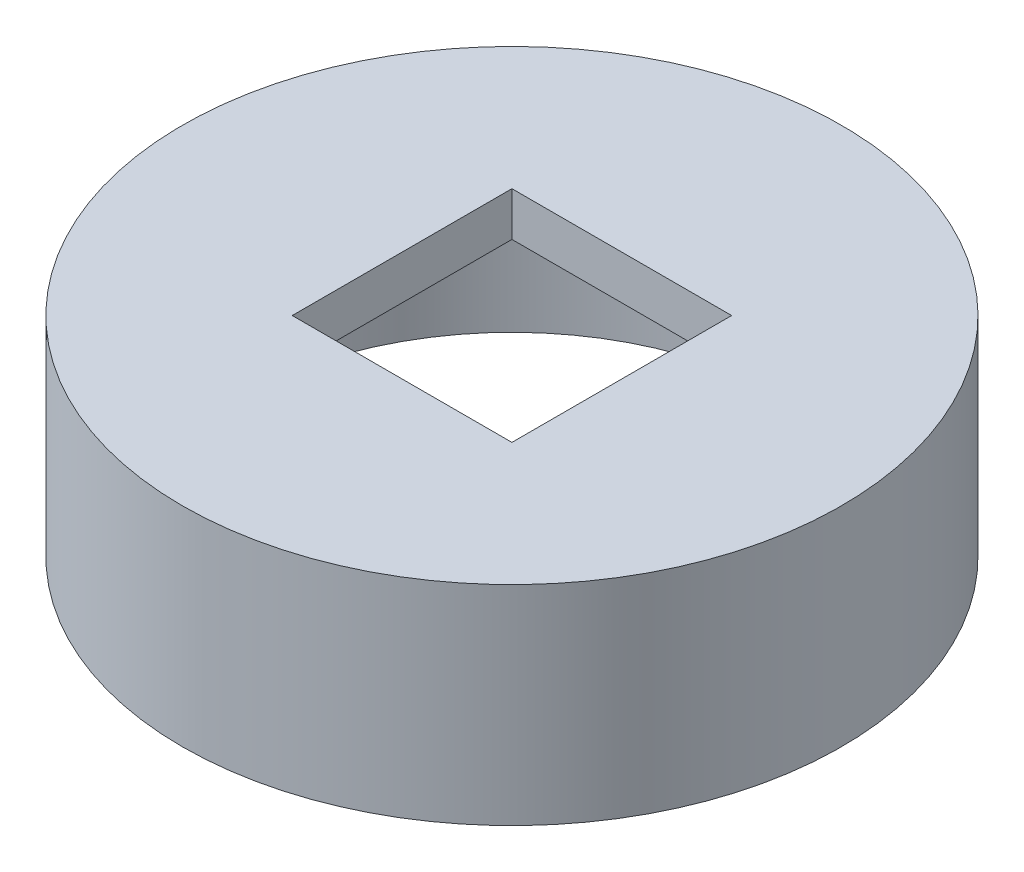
ISO-10303-21;
HEADER;
FILE_DESCRIPTION(('STEP AP214'),'2;1');
FILE_NAME('part.step','',(''),(''),'','','');
FILE_SCHEMA(('AUTOMOTIVE_DESIGN { 1 0 10303 214 1 1 1 1 }'));
ENDSEC;
DATA;
#1=APPLICATION_CONTEXT('core data for automotive mechanical design processes');
#2=APPLICATION_PROTOCOL_DEFINITION('international standard','automotive_design',2000,#1);
#3=PRODUCT_CONTEXT('',#1,'mechanical');
#4=PRODUCT('Part','Part','',(#3));
#5=PRODUCT_RELATED_PRODUCT_CATEGORY('part','',(#4));
#6=PRODUCT_DEFINITION_FORMATION('','',#4);
#7=PRODUCT_DEFINITION_CONTEXT('part definition',#1,'design');
#8=PRODUCT_DEFINITION('design','',#6,#7);
#9=PRODUCT_DEFINITION_SHAPE('','',#8);
#10=(LENGTH_UNIT() NAMED_UNIT(*) SI_UNIT(.MILLI.,.METRE.));
#11=(NAMED_UNIT(*) PLANE_ANGLE_UNIT() SI_UNIT($,.RADIAN.));
#12=(NAMED_UNIT(*) SI_UNIT($,.STERADIAN.) SOLID_ANGLE_UNIT());
#13=UNCERTAINTY_MEASURE_WITH_UNIT(LENGTH_MEASURE(1.E-05),#10,'distance_accuracy_value','');
#14=(GEOMETRIC_REPRESENTATION_CONTEXT(3) GLOBAL_UNCERTAINTY_ASSIGNED_CONTEXT((#13)) GLOBAL_UNIT_ASSIGNED_CONTEXT((#10,
#11,#12)) REPRESENTATION_CONTEXT('',''));
#15=CARTESIAN_POINT('',(0.,0.,0.));
#16=DIRECTION('',(0.,0.,1.));
#17=DIRECTION('',(1.,0.,0.));
#18=AXIS2_PLACEMENT_3D('',#15,#16,#17);
#19=CARTESIAN_POINT('',(0.,0.,0.));
#20=DIRECTION('',(0.,1.,0.));
#21=DIRECTION('',(0.,0.,1.));
#22=AXIS2_PLACEMENT_3D('',#19,#20,#21);
#23=PLANE('',#22);
#24=CARTESIAN_POINT('',(0.,0.,0.));
#25=DIRECTION('',(0.,1.,0.));
#26=DIRECTION('',(0.,0.,1.));
#27=AXIS2_PLACEMENT_3D('',#24,#25,#26);
#28=CIRCLE('',#27,60.);
#29=CARTESIAN_POINT('',(0.,0.,60.));
#30=VERTEX_POINT('',#29);
#31=EDGE_CURVE('E11',#30,#30,#28,.T.);
#32=ORIENTED_EDGE('',*,*,#31,.F.);
#33=EDGE_LOOP('',(#32));
#34=FACE_BOUND('',#33,.T.);
#35=CARTESIAN_POINT('',(0.,0.,0.));
#36=DIRECTION('',(0.,1.,0.));
#37=DIRECTION('',(0.,0.,1.));
#38=AXIS2_PLACEMENT_3D('',#35,#36,#37);
#39=CIRCLE('',#38,50.);
#40=CARTESIAN_POINT('',(0.,0.,50.));
#41=VERTEX_POINT('',#40);
#42=EDGE_CURVE('E41',#41,#41,#39,.T.);
#43=ORIENTED_EDGE('',*,*,#42,.T.);
#44=EDGE_LOOP('',(#43));
#45=FACE_BOUND('',#44,.T.);
#46=ADVANCED_FACE('F33',(#34,#45),#23,.F.);
#47=CARTESIAN_POINT('',(0.,30.,0.));
#48=DIRECTION('',(0.,-1.,0.));
#49=DIRECTION('',(0.,0.,-1.));
#50=AXIS2_PLACEMENT_3D('',#47,#48,#49);
#51=CYLINDRICAL_SURFACE('',#50,60.);
#52=ORIENTED_EDGE('',*,*,#31,.T.);
#53=EDGE_LOOP('',(#52));
#54=FACE_BOUND('',#53,.T.);
#55=CARTESIAN_POINT('',(0.,38.,0.));
#56=DIRECTION('',(0.,1.,0.));
#57=DIRECTION('',(0.,0.,1.));
#58=AXIS2_PLACEMENT_3D('',#55,#56,#57);
#59=CIRCLE('',#58,60.);
#60=CARTESIAN_POINT('',(0.,38.,60.));
#61=VERTEX_POINT('',#60);
#62=EDGE_CURVE('E111',#61,#61,#59,.T.);
#63=ORIENTED_EDGE('',*,*,#62,.F.);
#64=EDGE_LOOP('',(#63));
#65=FACE_BOUND('',#64,.T.);
#66=ADVANCED_FACE('F35',(#54,#65),#51,.T.);
#67=CARTESIAN_POINT('',(0.,30.,0.));
#68=DIRECTION('',(0.,-1.,0.));
#69=DIRECTION('',(0.,0.,-1.));
#70=AXIS2_PLACEMENT_3D('',#67,#68,#69);
#71=CYLINDRICAL_SURFACE('',#70,50.);
#72=CARTESIAN_POINT('',(0.,30.,0.));
#73=DIRECTION('',(0.,1.,0.));
#74=DIRECTION('',(0.,0.,1.));
#75=AXIS2_PLACEMENT_3D('',#72,#73,#74);
#76=CIRCLE('',#75,50.);
#77=CARTESIAN_POINT('',(0.,30.,50.));
#78=VERTEX_POINT('',#77);
#79=EDGE_CURVE('E114',#78,#78,#76,.T.);
#80=ORIENTED_EDGE('',*,*,#79,.T.);
#81=EDGE_LOOP('',(#80));
#82=FACE_BOUND('',#81,.T.);
#83=ORIENTED_EDGE('',*,*,#42,.F.);
#84=EDGE_LOOP('',(#83));
#85=FACE_BOUND('',#84,.T.);
#86=ADVANCED_FACE('F120',(#82,#85),#71,.F.);
#87=CARTESIAN_POINT('',(0.,30.,0.));
#88=DIRECTION('',(0.,1.,0.));
#89=DIRECTION('',(0.,0.,1.));
#90=AXIS2_PLACEMENT_3D('',#87,#88,#89);
#91=PLANE('',#90);
#92=DIRECTION('',(1.,0.,0.));
#93=VECTOR('',#92,1.);
#94=CARTESIAN_POINT('',(0.,30.,20.));
#95=LINE('',#94,#93);
#96=CARTESIAN_POINT('',(-20.,30.,20.));
#97=VERTEX_POINT('',#96);
#98=CARTESIAN_POINT('',(20.,30.,20.));
#99=VERTEX_POINT('',#98);
#100=EDGE_CURVE('E105',#97,#99,#95,.T.);
#101=ORIENTED_EDGE('',*,*,#100,.T.);
#102=DIRECTION('',(0.,0.,-1.));
#103=VECTOR('',#102,1.);
#104=CARTESIAN_POINT('',(20.,30.,0.));
#105=LINE('',#104,#103);
#106=CARTESIAN_POINT('',(20.,30.,-20.));
#107=VERTEX_POINT('',#106);
#108=EDGE_CURVE('E108',#99,#107,#105,.T.);
#109=ORIENTED_EDGE('',*,*,#108,.T.);
#110=DIRECTION('',(-1.,0.,0.));
#111=VECTOR('',#110,1.);
#112=CARTESIAN_POINT('',(0.,30.,-20.));
#113=LINE('',#112,#111);
#114=CARTESIAN_POINT('',(-20.,30.,-20.));
#115=VERTEX_POINT('',#114);
#116=EDGE_CURVE('E100',#107,#115,#113,.T.);
#117=ORIENTED_EDGE('',*,*,#116,.T.);
#118=DIRECTION('',(0.,0.,1.));
#119=VECTOR('',#118,1.);
#120=CARTESIAN_POINT('',(-20.,30.,0.));
#121=LINE('',#120,#119);
#122=EDGE_CURVE('E80',#115,#97,#121,.T.);
#123=ORIENTED_EDGE('',*,*,#122,.T.);
#124=EDGE_LOOP('',(#101,#109,#117,#123));
#125=FACE_BOUND('',#124,.T.);
#126=ORIENTED_EDGE('',*,*,#79,.F.);
#127=EDGE_LOOP('',(#126));
#128=FACE_BOUND('',#127,.T.);
#129=ADVANCED_FACE('F122',(#125,#128),#91,.F.);
#130=CARTESIAN_POINT('',(0.,38.,0.));
#131=DIRECTION('',(0.,1.,0.));
#132=DIRECTION('',(0.,0.,1.));
#133=AXIS2_PLACEMENT_3D('',#130,#131,#132);
#134=PLANE('',#133);
#135=DIRECTION('',(0.,0.,-1.));
#136=VECTOR('',#135,1.);
#137=CARTESIAN_POINT('',(20.,38.,-20.));
#138=LINE('',#137,#136);
#139=CARTESIAN_POINT('',(20.,38.,20.));
#140=VERTEX_POINT('',#139);
#141=CARTESIAN_POINT('',(20.,38.,-20.));
#142=VERTEX_POINT('',#141);
#143=EDGE_CURVE('E56',#140,#142,#138,.T.);
#144=ORIENTED_EDGE('',*,*,#143,.F.);
#145=DIRECTION('',(1.,0.,0.));
#146=VECTOR('',#145,1.);
#147=CARTESIAN_POINT('',(20.,38.,20.));
#148=LINE('',#147,#146);
#149=CARTESIAN_POINT('',(-20.,38.,20.));
#150=VERTEX_POINT('',#149);
#151=EDGE_CURVE('E93',#150,#140,#148,.T.);
#152=ORIENTED_EDGE('',*,*,#151,.F.);
#153=DIRECTION('',(0.,0.,1.));
#154=VECTOR('',#153,1.);
#155=CARTESIAN_POINT('',(-20.,38.,-20.));
#156=LINE('',#155,#154);
#157=CARTESIAN_POINT('',(-20.,38.,-20.));
#158=VERTEX_POINT('',#157);
#159=EDGE_CURVE('E77',#158,#150,#156,.T.);
#160=ORIENTED_EDGE('',*,*,#159,.F.);
#161=DIRECTION('',(-1.,0.,0.));
#162=VECTOR('',#161,1.);
#163=CARTESIAN_POINT('',(20.,38.,-20.));
#164=LINE('',#163,#162);
#165=EDGE_CURVE('E86',#142,#158,#164,.T.);
#166=ORIENTED_EDGE('',*,*,#165,.F.);
#167=EDGE_LOOP('',(#144,#152,#160,#166));
#168=FACE_BOUND('',#167,.T.);
#169=ORIENTED_EDGE('',*,*,#62,.T.);
#170=EDGE_LOOP('',(#169));
#171=FACE_BOUND('',#170,.T.);
#172=ADVANCED_FACE('F90',(#168,#171),#134,.T.);
#173=CARTESIAN_POINT('',(20.,0.,-20.));
#174=DIRECTION('',(1.,0.,0.));
#175=DIRECTION('',(0.,0.,-1.));
#176=AXIS2_PLACEMENT_3D('',#173,#174,#175);
#177=PLANE('',#176);
#178=DIRECTION('',(0.,1.,0.));
#179=VECTOR('',#178,1.);
#180=CARTESIAN_POINT('',(20.,0.,20.));
#181=LINE('',#180,#179);
#182=EDGE_CURVE('E98',#99,#140,#181,.T.);
#183=ORIENTED_EDGE('',*,*,#182,.T.);
#184=ORIENTED_EDGE('',*,*,#143,.T.);
#185=DIRECTION('',(0.,1.,0.));
#186=VECTOR('',#185,1.);
#187=CARTESIAN_POINT('',(20.,0.,-20.));
#188=LINE('',#187,#186);
#189=EDGE_CURVE('E83',#107,#142,#188,.T.);
#190=ORIENTED_EDGE('',*,*,#189,.F.);
#191=ORIENTED_EDGE('',*,*,#108,.F.);
#192=EDGE_LOOP('',(#183,#184,#190,#191));
#193=FACE_BOUND('',#192,.T.);
#194=ADVANCED_FACE('F140',(#193),#177,.F.);
#195=CARTESIAN_POINT('',(20.,0.,20.));
#196=DIRECTION('',(0.,0.,1.));
#197=DIRECTION('',(1.,0.,0.));
#198=AXIS2_PLACEMENT_3D('',#195,#196,#197);
#199=PLANE('',#198);
#200=DIRECTION('',(0.,1.,0.));
#201=VECTOR('',#200,1.);
#202=CARTESIAN_POINT('',(-20.,0.,20.));
#203=LINE('',#202,#201);
#204=EDGE_CURVE('E82',#97,#150,#203,.T.);
#205=ORIENTED_EDGE('',*,*,#204,.T.);
#206=ORIENTED_EDGE('',*,*,#151,.T.);
#207=ORIENTED_EDGE('',*,*,#182,.F.);
#208=ORIENTED_EDGE('',*,*,#100,.F.);
#209=EDGE_LOOP('',(#205,#206,#207,#208));
#210=FACE_BOUND('',#209,.T.);
#211=ADVANCED_FACE('F145',(#210),#199,.F.);
#212=CARTESIAN_POINT('',(-20.,0.,-20.));
#213=DIRECTION('',(-1.,0.,0.));
#214=DIRECTION('',(0.,0.,1.));
#215=AXIS2_PLACEMENT_3D('',#212,#213,#214);
#216=PLANE('',#215);
#217=DIRECTION('',(0.,1.,0.));
#218=VECTOR('',#217,1.);
#219=CARTESIAN_POINT('',(-20.,0.,-20.));
#220=LINE('',#219,#218);
#221=EDGE_CURVE('E48',#115,#158,#220,.T.);
#222=ORIENTED_EDGE('',*,*,#221,.T.);
#223=ORIENTED_EDGE('',*,*,#159,.T.);
#224=ORIENTED_EDGE('',*,*,#204,.F.);
#225=ORIENTED_EDGE('',*,*,#122,.F.);
#226=EDGE_LOOP('',(#222,#223,#224,#225));
#227=FACE_BOUND('',#226,.T.);
#228=ADVANCED_FACE('F74',(#227),#216,.F.);
#229=CARTESIAN_POINT('',(20.,0.,-20.));
#230=DIRECTION('',(0.,0.,-1.));
#231=DIRECTION('',(-1.,0.,0.));
#232=AXIS2_PLACEMENT_3D('',#229,#230,#231);
#233=PLANE('',#232);
#234=ORIENTED_EDGE('',*,*,#189,.T.);
#235=ORIENTED_EDGE('',*,*,#165,.T.);
#236=ORIENTED_EDGE('',*,*,#221,.F.);
#237=ORIENTED_EDGE('',*,*,#116,.F.);
#238=EDGE_LOOP('',(#234,#235,#236,#237));
#239=FACE_BOUND('',#238,.T.);
#240=ADVANCED_FACE('F87',(#239),#233,.F.);
#241=CLOSED_SHELL('',(#46,#66,#86,#129,#172,#194,#211,#228,#240));
#242=MANIFOLD_SOLID_BREP('B2',#241);
#243=ADVANCED_BREP_SHAPE_REPRESENTATION('',(#18,#242),#14);
#244=SHAPE_DEFINITION_REPRESENTATION(#9,#243);
ENDSEC;
END-ISO-10303-21;
